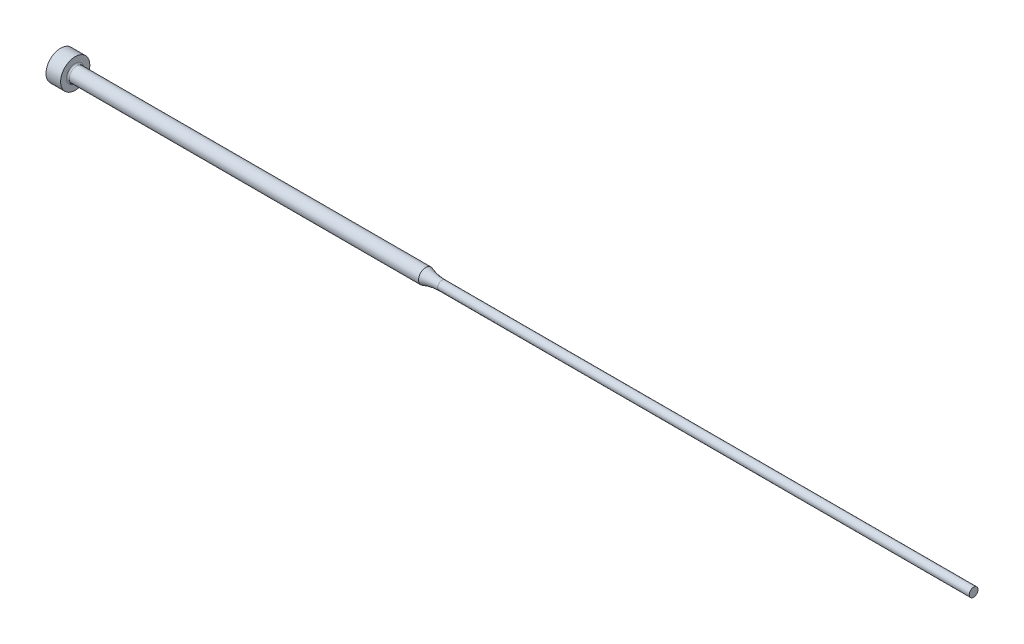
ISO-10303-21;
HEADER;
FILE_DESCRIPTION(('STEP AP214'),'2;1');
FILE_NAME('part.step','',(''),(''),'','','');
FILE_SCHEMA(('AUTOMOTIVE_DESIGN { 1 0 10303 214 1 1 1 1 }'));
ENDSEC;
DATA;
#1=APPLICATION_CONTEXT('core data for automotive mechanical design processes');
#2=APPLICATION_PROTOCOL_DEFINITION('international standard','automotive_design',2000,#1);
#3=PRODUCT_CONTEXT('',#1,'mechanical');
#4=PRODUCT('Part','Part','',(#3));
#5=PRODUCT_RELATED_PRODUCT_CATEGORY('part','',(#4));
#6=PRODUCT_DEFINITION_FORMATION('','',#4);
#7=PRODUCT_DEFINITION_CONTEXT('part definition',#1,'design');
#8=PRODUCT_DEFINITION('design','',#6,#7);
#9=PRODUCT_DEFINITION_SHAPE('','',#8);
#10=(LENGTH_UNIT() NAMED_UNIT(*) SI_UNIT(.MILLI.,.METRE.));
#11=(NAMED_UNIT(*) PLANE_ANGLE_UNIT() SI_UNIT($,.RADIAN.));
#12=(NAMED_UNIT(*) SI_UNIT($,.STERADIAN.) SOLID_ANGLE_UNIT());
#13=UNCERTAINTY_MEASURE_WITH_UNIT(LENGTH_MEASURE(1.E-05),#10,'distance_accuracy_value','');
#14=(GEOMETRIC_REPRESENTATION_CONTEXT(3) GLOBAL_UNCERTAINTY_ASSIGNED_CONTEXT((#13)) GLOBAL_UNIT_ASSIGNED_CONTEXT((#10,
#11,#12)) REPRESENTATION_CONTEXT('',''));
#15=CARTESIAN_POINT('',(0.,0.,0.));
#16=DIRECTION('',(0.,0.,1.));
#17=DIRECTION('',(1.,0.,0.));
#18=AXIS2_PLACEMENT_3D('',#15,#16,#17);
#19=CARTESIAN_POINT('',(126.175,1.78125000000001,0.));
#20=DIRECTION('',(-1.,0.,0.));
#21=DIRECTION('',(0.,-1.,0.));
#22=AXIS2_PLACEMENT_3D('',#19,#20,#21);
#23=PLANE('',#22);
#24=CARTESIAN_POINT('',(126.175,1.18125000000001,0.));
#25=DIRECTION('',(-1.,0.,0.));
#26=DIRECTION('',(0.,-1.,0.));
#27=AXIS2_PLACEMENT_3D('',#24,#25,#26);
#28=CIRCLE('',#27,0.6);
#29=CARTESIAN_POINT('',(126.175,0.581250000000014,0.));
#30=VERTEX_POINT('',#29);
#31=EDGE_CURVE('E10',#30,#30,#28,.T.);
#32=ORIENTED_EDGE('',*,*,#31,.F.);
#33=EDGE_LOOP('',(#32));
#34=FACE_BOUND('',#33,.T.);
#35=ADVANCED_FACE('F29',(#34),#23,.F.);
#36=CARTESIAN_POINT('',(126.175,1.18125000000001,0.));
#37=DIRECTION('',(-1.,0.,0.));
#38=DIRECTION('',(0.,-1.,0.));
#39=AXIS2_PLACEMENT_3D('',#36,#37,#38);
#40=CYLINDRICAL_SURFACE('',#39,0.6);
#41=CARTESIAN_POINT('',(53.3931073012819,1.18125000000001,0.));
#42=DIRECTION('',(-1.,0.,0.));
#43=DIRECTION('',(0.,-1.,0.));
#44=AXIS2_PLACEMENT_3D('',#41,#42,#43);
#45=CIRCLE('',#44,0.599999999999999);
#46=CARTESIAN_POINT('',(53.3931073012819,0.581250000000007,0.));
#47=VERTEX_POINT('',#46);
#48=EDGE_CURVE('E35',#47,#47,#45,.T.);
#49=ORIENTED_EDGE('',*,*,#48,.F.);
#50=EDGE_LOOP('',(#49));
#51=FACE_BOUND('',#50,.T.);
#52=ORIENTED_EDGE('',*,*,#31,.T.);
#53=EDGE_LOOP('',(#52));
#54=FACE_BOUND('',#53,.T.);
#55=ADVANCED_FACE('F86',(#51,#54),#40,.T.);
#56=CARTESIAN_POINT('',(53.3931073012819,1.18125000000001,0.));
#57=DIRECTION('',(-1.,0.,0.));
#58=DIRECTION('',(0.,-1.,0.));
#59=AXIS2_PLACEMENT_3D('',#56,#57,#58);
#60=TOROIDAL_SURFACE('',#59,6.95000000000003,6.35000000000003);
#61=CARTESIAN_POINT('',(51.175,1.18125000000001,0.));
#62=DIRECTION('',(-1.,0.,0.));
#63=DIRECTION('',(0.,-1.,0.));
#64=AXIS2_PLACEMENT_3D('',#61,#62,#63);
#65=CIRCLE('',#64,0.999999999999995);
#66=CARTESIAN_POINT('',(51.175,0.18125000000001,0.));
#67=VERTEX_POINT('',#66);
#68=EDGE_CURVE('E39',#67,#67,#65,.T.);
#69=ORIENTED_EDGE('',*,*,#68,.F.);
#70=EDGE_LOOP('',(#69));
#71=FACE_BOUND('',#70,.T.);
#72=ORIENTED_EDGE('',*,*,#48,.T.);
#73=EDGE_LOOP('',(#72));
#74=FACE_BOUND('',#73,.T.);
#75=ADVANCED_FACE('F81',(#71,#74),#60,.F.);
#76=CARTESIAN_POINT('',(126.175,1.18125000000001,0.));
#77=DIRECTION('',(-1.,0.,0.));
#78=DIRECTION('',(0.,-1.,0.));
#79=AXIS2_PLACEMENT_3D('',#76,#77,#78);
#80=CYLINDRICAL_SURFACE('',#79,0.999999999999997);
#81=CARTESIAN_POINT('',(3.375,1.18125,0.));
#82=DIRECTION('',(-1.,0.,0.));
#83=DIRECTION('',(0.,-1.,0.));
#84=AXIS2_PLACEMENT_3D('',#81,#82,#83);
#85=CIRCLE('',#84,1.);
#86=CARTESIAN_POINT('',(3.375,0.181250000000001,0.));
#87=VERTEX_POINT('',#86);
#88=EDGE_CURVE('E43',#87,#87,#85,.T.);
#89=ORIENTED_EDGE('',*,*,#88,.F.);
#90=EDGE_LOOP('',(#89));
#91=FACE_BOUND('',#90,.T.);
#92=ORIENTED_EDGE('',*,*,#68,.T.);
#93=EDGE_LOOP('',(#92));
#94=FACE_BOUND('',#93,.T.);
#95=ADVANCED_FACE('F75',(#91,#94),#80,.T.);
#96=CARTESIAN_POINT('',(3.375,1.18125,0.));
#97=DIRECTION('',(-1.,0.,0.));
#98=DIRECTION('',(0.,-1.,0.));
#99=AXIS2_PLACEMENT_3D('',#96,#97,#98);
#100=TOROIDAL_SURFACE('',#99,1.2,0.2);
#101=CARTESIAN_POINT('',(3.175,1.18125,0.));
#102=DIRECTION('',(-1.,0.,0.));
#103=DIRECTION('',(0.,-1.,0.));
#104=AXIS2_PLACEMENT_3D('',#101,#102,#103);
#105=CIRCLE('',#104,1.2);
#106=CARTESIAN_POINT('',(3.175,-0.0187499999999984,0.));
#107=VERTEX_POINT('',#106);
#108=EDGE_CURVE('E48',#107,#107,#105,.T.);
#109=ORIENTED_EDGE('',*,*,#108,.F.);
#110=EDGE_LOOP('',(#109));
#111=FACE_BOUND('',#110,.T.);
#112=ORIENTED_EDGE('',*,*,#88,.T.);
#113=EDGE_LOOP('',(#112));
#114=FACE_BOUND('',#113,.T.);
#115=ADVANCED_FACE('F69',(#111,#114),#100,.F.);
#116=CARTESIAN_POINT('',(3.175,3.18125,0.));
#117=DIRECTION('',(-1.,0.,0.));
#118=DIRECTION('',(0.,-1.,0.));
#119=AXIS2_PLACEMENT_3D('',#116,#117,#118);
#120=PLANE('',#119);
#121=CARTESIAN_POINT('',(3.175,1.18125,0.));
#122=DIRECTION('',(-1.,0.,0.));
#123=DIRECTION('',(0.,-1.,0.));
#124=AXIS2_PLACEMENT_3D('',#121,#122,#123);
#125=CIRCLE('',#124,2.);
#126=CARTESIAN_POINT('',(3.175,-0.818749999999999,0.));
#127=VERTEX_POINT('',#126);
#128=EDGE_CURVE('E51',#127,#127,#125,.T.);
#129=ORIENTED_EDGE('',*,*,#128,.F.);
#130=EDGE_LOOP('',(#129));
#131=FACE_BOUND('',#130,.T.);
#132=ORIENTED_EDGE('',*,*,#108,.T.);
#133=EDGE_LOOP('',(#132));
#134=FACE_BOUND('',#133,.T.);
#135=ADVANCED_FACE('F63',(#131,#134),#120,.F.);
#136=CARTESIAN_POINT('',(126.175,1.18125000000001,0.));
#137=DIRECTION('',(-1.,0.,0.));
#138=DIRECTION('',(0.,-1.,0.));
#139=AXIS2_PLACEMENT_3D('',#136,#137,#138);
#140=CYLINDRICAL_SURFACE('',#139,2.);
#141=CARTESIAN_POINT('',(1.175,1.18125,0.));
#142=DIRECTION('',(-1.,0.,0.));
#143=DIRECTION('',(0.,-1.,0.));
#144=AXIS2_PLACEMENT_3D('',#141,#142,#143);
#145=CIRCLE('',#144,2.);
#146=CARTESIAN_POINT('',(1.175,-0.818749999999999,0.));
#147=VERTEX_POINT('',#146);
#148=EDGE_CURVE('E54',#147,#147,#145,.T.);
#149=ORIENTED_EDGE('',*,*,#148,.F.);
#150=EDGE_LOOP('',(#149));
#151=FACE_BOUND('',#150,.T.);
#152=ORIENTED_EDGE('',*,*,#128,.T.);
#153=EDGE_LOOP('',(#152));
#154=FACE_BOUND('',#153,.T.);
#155=ADVANCED_FACE('F60',(#151,#154),#140,.T.);
#156=CARTESIAN_POINT('',(1.175,1.18125,0.));
#157=DIRECTION('',(1.,0.,0.));
#158=DIRECTION('',(0.,1.,0.));
#159=AXIS2_PLACEMENT_3D('',#156,#157,#158);
#160=PLANE('',#159);
#161=ORIENTED_EDGE('',*,*,#148,.T.);
#162=EDGE_LOOP('',(#161));
#163=FACE_BOUND('',#162,.T.);
#164=ADVANCED_FACE('F58',(#163),#160,.F.);
#165=CLOSED_SHELL('',(#35,#55,#75,#95,#115,#135,#155,#164));
#166=MANIFOLD_SOLID_BREP('B2',#165);
#167=ADVANCED_BREP_SHAPE_REPRESENTATION('',(#18,#166),#14);
#168=SHAPE_DEFINITION_REPRESENTATION(#9,#167);
ENDSEC;
END-ISO-10303-21;
